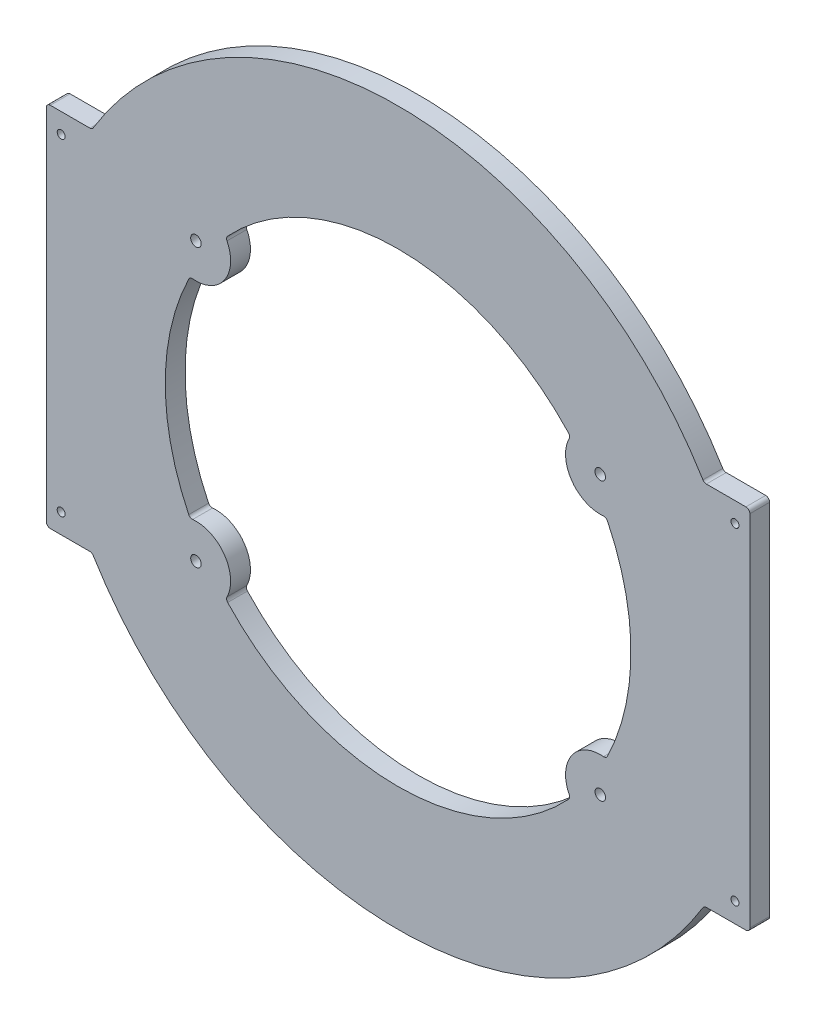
ISO-10303-21;
HEADER;
FILE_DESCRIPTION(('STEP AP214'),'2;1');
FILE_NAME('part.step','',(''),(''),'','','');
FILE_SCHEMA(('AUTOMOTIVE_DESIGN { 1 0 10303 214 1 1 1 1 }'));
ENDSEC;
DATA;
#1=APPLICATION_CONTEXT('core data for automotive mechanical design processes');
#2=APPLICATION_PROTOCOL_DEFINITION('international standard','automotive_design',2000,#1);
#3=PRODUCT_CONTEXT('',#1,'mechanical');
#4=PRODUCT('Part','Part','',(#3));
#5=PRODUCT_RELATED_PRODUCT_CATEGORY('part','',(#4));
#6=PRODUCT_DEFINITION_FORMATION('','',#4);
#7=PRODUCT_DEFINITION_CONTEXT('part definition',#1,'design');
#8=PRODUCT_DEFINITION('design','',#6,#7);
#9=PRODUCT_DEFINITION_SHAPE('','',#8);
#10=(LENGTH_UNIT() NAMED_UNIT(*) SI_UNIT(.MILLI.,.METRE.));
#11=(NAMED_UNIT(*) PLANE_ANGLE_UNIT() SI_UNIT($,.RADIAN.));
#12=(NAMED_UNIT(*) SI_UNIT($,.STERADIAN.) SOLID_ANGLE_UNIT());
#13=UNCERTAINTY_MEASURE_WITH_UNIT(LENGTH_MEASURE(1.E-05),#10,'distance_accuracy_value','');
#14=(GEOMETRIC_REPRESENTATION_CONTEXT(3) GLOBAL_UNCERTAINTY_ASSIGNED_CONTEXT((#13)) GLOBAL_UNIT_ASSIGNED_CONTEXT((#10,
#11,#12)) REPRESENTATION_CONTEXT('',''));
#15=CARTESIAN_POINT('',(0.,0.,0.));
#16=DIRECTION('',(0.,0.,1.));
#17=DIRECTION('',(1.,0.,0.));
#18=AXIS2_PLACEMENT_3D('',#15,#16,#17);
#19=CARTESIAN_POINT('',(0.,0.,12.7));
#20=DIRECTION('',(0.,0.,1.));
#21=DIRECTION('',(1.,0.,0.));
#22=AXIS2_PLACEMENT_3D('',#19,#20,#21);
#23=PLANE('',#22);
#24=CARTESIAN_POINT('',(215.9,104.775,12.7));
#25=DIRECTION('',(0.,0.,1.));
#26=DIRECTION('',(1.,0.,0.));
#27=AXIS2_PLACEMENT_3D('',#24,#25,#26);
#28=CIRCLE('',#27,2.55269999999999);
#29=CARTESIAN_POINT('',(218.4527,104.775,12.7));
#30=VERTEX_POINT('',#29);
#31=EDGE_CURVE('E551',#30,#30,#28,.T.);
#32=ORIENTED_EDGE('',*,*,#31,.F.);
#33=EDGE_LOOP('',(#32));
#34=FACE_BOUND('',#33,.T.);
#35=CARTESIAN_POINT('',(215.9,-104.775,12.7));
#36=DIRECTION('',(0.,0.,1.));
#37=DIRECTION('',(1.,0.,0.));
#38=AXIS2_PLACEMENT_3D('',#35,#36,#37);
#39=CIRCLE('',#38,2.55269999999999);
#40=CARTESIAN_POINT('',(218.4527,-104.775,12.7));
#41=VERTEX_POINT('',#40);
#42=EDGE_CURVE('E545',#41,#41,#39,.T.);
#43=ORIENTED_EDGE('',*,*,#42,.F.);
#44=EDGE_LOOP('',(#43));
#45=FACE_BOUND('',#44,.T.);
#46=CARTESIAN_POINT('',(-215.9,-104.775,12.7));
#47=DIRECTION('',(0.,0.,1.));
#48=DIRECTION('',(1.,0.,0.));
#49=AXIS2_PLACEMENT_3D('',#46,#47,#48);
#50=CIRCLE('',#49,2.55269999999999);
#51=CARTESIAN_POINT('',(-213.3473,-104.775,12.7));
#52=VERTEX_POINT('',#51);
#53=EDGE_CURVE('E539',#52,#52,#50,.T.);
#54=ORIENTED_EDGE('',*,*,#53,.F.);
#55=EDGE_LOOP('',(#54));
#56=FACE_BOUND('',#55,.T.);
#57=CARTESIAN_POINT('',(-215.9,104.775,12.7));
#58=DIRECTION('',(0.,0.,1.));
#59=DIRECTION('',(1.,0.,0.));
#60=AXIS2_PLACEMENT_3D('',#57,#58,#59);
#61=CIRCLE('',#60,2.55269999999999);
#62=CARTESIAN_POINT('',(-213.3473,104.775,12.7));
#63=VERTEX_POINT('',#62);
#64=EDGE_CURVE('E533',#63,#63,#61,.T.);
#65=ORIENTED_EDGE('',*,*,#64,.F.);
#66=EDGE_LOOP('',(#65));
#67=FACE_BOUND('',#66,.T.);
#68=CARTESIAN_POINT('',(0.,0.,12.7));
#69=DIRECTION('',(0.,0.,1.));
#70=DIRECTION('',(1.,0.,0.));
#71=AXIS2_PLACEMENT_3D('',#68,#69,#70);
#72=CIRCLE('',#71,149.225);
#73=CARTESIAN_POINT('',(109.230774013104,101.669752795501,12.7));
#74=VERTEX_POINT('',#73);
#75=CARTESIAN_POINT('',(-109.230774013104,101.669752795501,12.7));
#76=VERTEX_POINT('',#75);
#77=EDGE_CURVE('E433',#74,#76,#72,.T.);
#78=ORIENTED_EDGE('',*,*,#77,.F.);
#79=CARTESIAN_POINT('',(107.371526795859,99.9392038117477,12.7));
#80=DIRECTION('',(0.,0.,1.));
#81=DIRECTION('',(1.,0.,0.));
#82=AXIS2_PLACEMENT_3D('',#79,#80,#81);
#83=CIRCLE('',#82,2.54);
#84=CARTESIAN_POINT('',(109.645216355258,98.8069777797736,12.7));
#85=VERTEX_POINT('',#84);
#86=EDGE_CURVE('E386',#74,#85,#83,.F.);
#87=ORIENTED_EDGE('',*,*,#86,.T.);
#88=CARTESIAN_POINT('',(129.54,88.9000000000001,12.7));
#89=DIRECTION('',(0.,0.,1.));
#90=DIRECTION('',(1.,0.,0.));
#91=AXIS2_PLACEMENT_3D('',#88,#89,#90);
#92=CIRCLE('',#91,22.225);
#93=CARTESIAN_POINT('',(131.629045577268,66.7733980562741,12.7));
#94=VERTEX_POINT('',#93);
#95=EDGE_CURVE('E409',#85,#94,#92,.T.);
#96=ORIENTED_EDGE('',*,*,#95,.T.);
#97=CARTESIAN_POINT('',(131.867793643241,64.2446435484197,12.7));
#98=DIRECTION('',(0.,0.,1.));
#99=DIRECTION('',(1.,0.,0.));
#100=AXIS2_PLACEMENT_3D('',#97,#98,#99);
#101=CIRCLE('',#100,2.54);
#102=CARTESIAN_POINT('',(134.151218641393,65.3571049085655,12.7));
#103=VERTEX_POINT('',#102);
#104=EDGE_CURVE('E380',#94,#103,#101,.F.);
#105=ORIENTED_EDGE('',*,*,#104,.T.);
#106=CARTESIAN_POINT('',(134.151218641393,-65.3571049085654,12.7));
#107=VERTEX_POINT('',#106);
#108=EDGE_CURVE('E438',#107,#103,#72,.T.);
#109=ORIENTED_EDGE('',*,*,#108,.F.);
#110=CARTESIAN_POINT('',(131.867793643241,-64.2446435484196,12.7));
#111=DIRECTION('',(0.,0.,1.));
#112=DIRECTION('',(1.,0.,0.));
#113=AXIS2_PLACEMENT_3D('',#110,#111,#112);
#114=CIRCLE('',#113,2.54);
#115=CARTESIAN_POINT('',(131.629045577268,-66.773398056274,12.7));
#116=VERTEX_POINT('',#115);
#117=EDGE_CURVE('E390',#107,#116,#114,.F.);
#118=ORIENTED_EDGE('',*,*,#117,.T.);
#119=CARTESIAN_POINT('',(129.54,-88.9,12.7));
#120=DIRECTION('',(0.,0.,1.));
#121=DIRECTION('',(1.,0.,0.));
#122=AXIS2_PLACEMENT_3D('',#119,#120,#121);
#123=CIRCLE('',#122,22.225);
#124=CARTESIAN_POINT('',(109.645216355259,-98.8069777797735,12.7));
#125=VERTEX_POINT('',#124);
#126=EDGE_CURVE('E496',#116,#125,#123,.T.);
#127=ORIENTED_EDGE('',*,*,#126,.T.);
#128=CARTESIAN_POINT('',(107.371526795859,-99.9392038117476,12.7));
#129=DIRECTION('',(0.,0.,1.));
#130=DIRECTION('',(1.,0.,0.));
#131=AXIS2_PLACEMENT_3D('',#128,#129,#130);
#132=CIRCLE('',#131,2.54);
#133=CARTESIAN_POINT('',(109.230774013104,-101.669752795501,12.7));
#134=VERTEX_POINT('',#133);
#135=EDGE_CURVE('E392',#125,#134,#132,.F.);
#136=ORIENTED_EDGE('',*,*,#135,.T.);
#137=CARTESIAN_POINT('',(-109.230774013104,-101.669752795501,12.7));
#138=VERTEX_POINT('',#137);
#139=EDGE_CURVE('E432',#138,#134,#72,.T.);
#140=ORIENTED_EDGE('',*,*,#139,.F.);
#141=CARTESIAN_POINT('',(-107.37152679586,-99.9392038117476,12.7));
#142=DIRECTION('',(0.,0.,1.));
#143=DIRECTION('',(1.,0.,0.));
#144=AXIS2_PLACEMENT_3D('',#141,#142,#143);
#145=CIRCLE('',#144,2.54);
#146=CARTESIAN_POINT('',(-109.645216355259,-98.8069777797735,12.7));
#147=VERTEX_POINT('',#146);
#148=EDGE_CURVE('E366',#138,#147,#145,.F.);
#149=ORIENTED_EDGE('',*,*,#148,.T.);
#150=CARTESIAN_POINT('',(-129.54,-88.8999999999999,12.7));
#151=DIRECTION('',(0.,0.,1.));
#152=DIRECTION('',(1.,0.,0.));
#153=AXIS2_PLACEMENT_3D('',#150,#151,#152);
#154=CIRCLE('',#153,22.225);
#155=CARTESIAN_POINT('',(-131.629045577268,-66.773398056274,12.7));
#156=VERTEX_POINT('',#155);
#157=EDGE_CURVE('E490',#147,#156,#154,.T.);
#158=ORIENTED_EDGE('',*,*,#157,.T.);
#159=CARTESIAN_POINT('',(-131.867793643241,-64.2446435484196,12.7));
#160=DIRECTION('',(0.,0.,1.));
#161=DIRECTION('',(1.,0.,0.));
#162=AXIS2_PLACEMENT_3D('',#159,#160,#161);
#163=CIRCLE('',#162,2.54);
#164=CARTESIAN_POINT('',(-134.151218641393,-65.3571049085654,12.7));
#165=VERTEX_POINT('',#164);
#166=EDGE_CURVE('E368',#156,#165,#163,.F.);
#167=ORIENTED_EDGE('',*,*,#166,.T.);
#168=CARTESIAN_POINT('',(-134.151218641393,65.3571049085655,12.7));
#169=VERTEX_POINT('',#168);
#170=EDGE_CURVE('E428',#169,#165,#72,.T.);
#171=ORIENTED_EDGE('',*,*,#170,.F.);
#172=CARTESIAN_POINT('',(-131.867793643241,64.2446435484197,12.7));
#173=DIRECTION('',(0.,0.,1.));
#174=DIRECTION('',(1.,0.,0.));
#175=AXIS2_PLACEMENT_3D('',#172,#173,#174);
#176=CIRCLE('',#175,2.54);
#177=CARTESIAN_POINT('',(-131.629045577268,66.7733980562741,12.7));
#178=VERTEX_POINT('',#177);
#179=EDGE_CURVE('E374',#169,#178,#176,.F.);
#180=ORIENTED_EDGE('',*,*,#179,.T.);
#181=CARTESIAN_POINT('',(-129.54,88.9000000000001,12.7));
#182=DIRECTION('',(0.,0.,1.));
#183=DIRECTION('',(1.,0.,0.));
#184=AXIS2_PLACEMENT_3D('',#181,#182,#183);
#185=CIRCLE('',#184,22.225);
#186=CARTESIAN_POINT('',(-109.645216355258,98.8069777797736,12.7));
#187=VERTEX_POINT('',#186);
#188=EDGE_CURVE('E484',#178,#187,#185,.T.);
#189=ORIENTED_EDGE('',*,*,#188,.T.);
#190=CARTESIAN_POINT('',(-107.371526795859,99.9392038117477,12.7));
#191=DIRECTION('',(0.,0.,1.));
#192=DIRECTION('',(1.,0.,0.));
#193=AXIS2_PLACEMENT_3D('',#190,#191,#192);
#194=CIRCLE('',#193,2.54);
#195=EDGE_CURVE('E376',#187,#76,#194,.F.);
#196=ORIENTED_EDGE('',*,*,#195,.T.);
#197=EDGE_LOOP('',(#78,#87,#96,#105,#109,#118,#127,#136,#140,#149,#158,#167,#171,#180,#189,#196));
#198=FACE_BOUND('',#197,.T.);
#199=CARTESIAN_POINT('',(-129.54,88.9000000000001,12.7));
#200=DIRECTION('',(0.,0.,1.));
#201=DIRECTION('',(1.,0.,0.));
#202=AXIS2_PLACEMENT_3D('',#199,#200,#201);
#203=CIRCLE('',#202,3.3782);
#204=CARTESIAN_POINT('',(-126.1618,88.9000000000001,12.7));
#205=VERTEX_POINT('',#204);
#206=EDGE_CURVE('E480',#205,#205,#203,.T.);
#207=ORIENTED_EDGE('',*,*,#206,.F.);
#208=EDGE_LOOP('',(#207));
#209=FACE_BOUND('',#208,.T.);
#210=CARTESIAN_POINT('',(-129.54,-88.8999999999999,12.7));
#211=DIRECTION('',(0.,0.,1.));
#212=DIRECTION('',(1.,0.,0.));
#213=AXIS2_PLACEMENT_3D('',#210,#211,#212);
#214=CIRCLE('',#213,3.3782);
#215=CARTESIAN_POINT('',(-126.1618,-88.8999999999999,12.7));
#216=VERTEX_POINT('',#215);
#217=EDGE_CURVE('E474',#216,#216,#214,.T.);
#218=ORIENTED_EDGE('',*,*,#217,.F.);
#219=EDGE_LOOP('',(#218));
#220=FACE_BOUND('',#219,.T.);
#221=CARTESIAN_POINT('',(129.54,-88.9,12.7));
#222=DIRECTION('',(0.,0.,1.));
#223=DIRECTION('',(1.,0.,0.));
#224=AXIS2_PLACEMENT_3D('',#221,#222,#223);
#225=CIRCLE('',#224,3.3782);
#226=CARTESIAN_POINT('',(132.9182,-88.9,12.7));
#227=VERTEX_POINT('',#226);
#228=EDGE_CURVE('E468',#227,#227,#225,.T.);
#229=ORIENTED_EDGE('',*,*,#228,.F.);
#230=EDGE_LOOP('',(#229));
#231=FACE_BOUND('',#230,.T.);
#232=CARTESIAN_POINT('',(129.54,88.9000000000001,12.7));
#233=DIRECTION('',(0.,0.,1.));
#234=DIRECTION('',(1.,0.,0.));
#235=AXIS2_PLACEMENT_3D('',#232,#233,#234);
#236=CIRCLE('',#235,3.3782);
#237=CARTESIAN_POINT('',(132.9182,88.9000000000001,12.7));
#238=VERTEX_POINT('',#237);
#239=EDGE_CURVE('E459',#238,#238,#236,.T.);
#240=ORIENTED_EDGE('',*,*,#239,.F.);
#241=EDGE_LOOP('',(#240));
#242=FACE_BOUND('',#241,.T.);
#243=DIRECTION('',(0.,1.,0.));
#244=VECTOR('',#243,1.);
#245=CARTESIAN_POINT('',(225.425,117.475,12.7));
#246=LINE('',#245,#244);
#247=CARTESIAN_POINT('',(225.425,-114.935,12.7));
#248=VERTEX_POINT('',#247);
#249=CARTESIAN_POINT('',(225.425,114.935,12.7));
#250=VERTEX_POINT('',#249);
#251=EDGE_CURVE('E510',#248,#250,#246,.T.);
#252=ORIENTED_EDGE('',*,*,#251,.T.);
#253=CARTESIAN_POINT('',(222.885,114.935,12.7));
#254=DIRECTION('',(0.,0.,1.));
#255=DIRECTION('',(1.,0.,0.));
#256=AXIS2_PLACEMENT_3D('',#253,#254,#255);
#257=CIRCLE('',#256,2.54);
#258=CARTESIAN_POINT('',(222.885,117.475,12.7));
#259=VERTEX_POINT('',#258);
#260=EDGE_CURVE('E266',#250,#259,#257,.T.);
#261=ORIENTED_EDGE('',*,*,#260,.T.);
#262=DIRECTION('',(-1.,0.,0.));
#263=VECTOR('',#262,1.);
#264=CARTESIAN_POINT('',(225.425,117.475,12.7));
#265=LINE('',#264,#263);
#266=CARTESIAN_POINT('',(197.540120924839,117.475,12.7));
#267=VERTEX_POINT('',#266);
#268=EDGE_CURVE('E416',#259,#267,#265,.T.);
#269=ORIENTED_EDGE('',*,*,#268,.T.);
#270=CARTESIAN_POINT('',(197.540120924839,120.015,12.7));
#271=DIRECTION('',(0.,0.,1.));
#272=DIRECTION('',(1.,0.,0.));
#273=AXIS2_PLACEMENT_3D('',#270,#271,#272);
#274=CIRCLE('',#273,2.54);
#275=CARTESIAN_POINT('',(195.369350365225,118.696153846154,12.7));
#276=VERTEX_POINT('',#275);
#277=EDGE_CURVE('E11',#267,#276,#274,.F.);
#278=ORIENTED_EDGE('',*,*,#277,.T.);
#279=CARTESIAN_POINT('',(0.,0.,12.7));
#280=DIRECTION('',(0.,0.,1.));
#281=DIRECTION('',(1.,0.,0.));
#282=AXIS2_PLACEMENT_3D('',#279,#280,#281);
#283=CIRCLE('',#282,228.6);
#284=CARTESIAN_POINT('',(-195.369350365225,118.696153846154,12.7));
#285=VERTEX_POINT('',#284);
#286=EDGE_CURVE('E271',#276,#285,#283,.T.);
#287=ORIENTED_EDGE('',*,*,#286,.T.);
#288=CARTESIAN_POINT('',(-197.540120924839,120.015,12.7));
#289=DIRECTION('',(0.,0.,1.));
#290=DIRECTION('',(1.,0.,0.));
#291=AXIS2_PLACEMENT_3D('',#288,#289,#290);
#292=CIRCLE('',#291,2.54);
#293=CARTESIAN_POINT('',(-197.540120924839,117.475,12.7));
#294=VERTEX_POINT('',#293);
#295=EDGE_CURVE('E362',#285,#294,#292,.F.);
#296=ORIENTED_EDGE('',*,*,#295,.T.);
#297=DIRECTION('',(1.,0.,0.));
#298=VECTOR('',#297,1.);
#299=CARTESIAN_POINT('',(-225.425,117.475,12.7));
#300=LINE('',#299,#298);
#301=CARTESIAN_POINT('',(-222.885,117.475,12.7));
#302=VERTEX_POINT('',#301);
#303=EDGE_CURVE('E518',#302,#294,#300,.T.);
#304=ORIENTED_EDGE('',*,*,#303,.F.);
#305=CARTESIAN_POINT('',(-222.885,114.935,12.7));
#306=DIRECTION('',(0.,0.,1.));
#307=DIRECTION('',(1.,0.,0.));
#308=AXIS2_PLACEMENT_3D('',#305,#306,#307);
#309=CIRCLE('',#308,2.54);
#310=CARTESIAN_POINT('',(-225.425,114.935,12.7));
#311=VERTEX_POINT('',#310);
#312=EDGE_CURVE('E269',#302,#311,#309,.T.);
#313=ORIENTED_EDGE('',*,*,#312,.T.);
#314=DIRECTION('',(0.,1.,0.));
#315=VECTOR('',#314,1.);
#316=CARTESIAN_POINT('',(-225.425,117.475,12.7));
#317=LINE('',#316,#315);
#318=CARTESIAN_POINT('',(-225.425,-114.935,12.7));
#319=VERTEX_POINT('',#318);
#320=EDGE_CURVE('E523',#319,#311,#317,.T.);
#321=ORIENTED_EDGE('',*,*,#320,.F.);
#322=CARTESIAN_POINT('',(-222.885,-114.935,12.7));
#323=DIRECTION('',(0.,0.,1.));
#324=DIRECTION('',(1.,0.,0.));
#325=AXIS2_PLACEMENT_3D('',#322,#323,#324);
#326=CIRCLE('',#325,2.54);
#327=CARTESIAN_POINT('',(-222.885,-117.475,12.7));
#328=VERTEX_POINT('',#327);
#329=EDGE_CURVE('E267',#319,#328,#326,.T.);
#330=ORIENTED_EDGE('',*,*,#329,.T.);
#331=DIRECTION('',(-1.,0.,0.));
#332=VECTOR('',#331,1.);
#333=CARTESIAN_POINT('',(-225.425,-117.475,12.7));
#334=LINE('',#333,#332);
#335=CARTESIAN_POINT('',(-197.540120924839,-117.475,12.7));
#336=VERTEX_POINT('',#335);
#337=EDGE_CURVE('E521',#336,#328,#334,.T.);
#338=ORIENTED_EDGE('',*,*,#337,.F.);
#339=CARTESIAN_POINT('',(-197.540120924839,-120.015,12.7));
#340=DIRECTION('',(0.,0.,1.));
#341=DIRECTION('',(1.,0.,0.));
#342=AXIS2_PLACEMENT_3D('',#339,#340,#341);
#343=CIRCLE('',#342,2.54);
#344=CARTESIAN_POINT('',(-195.369350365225,-118.696153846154,12.7));
#345=VERTEX_POINT('',#344);
#346=EDGE_CURVE('E357',#336,#345,#343,.F.);
#347=ORIENTED_EDGE('',*,*,#346,.T.);
#348=CARTESIAN_POINT('',(195.369350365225,-118.696153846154,12.7));
#349=VERTEX_POINT('',#348);
#350=EDGE_CURVE('E420',#345,#349,#283,.T.);
#351=ORIENTED_EDGE('',*,*,#350,.T.);
#352=CARTESIAN_POINT('',(197.540120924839,-120.015,12.7));
#353=DIRECTION('',(0.,0.,1.));
#354=DIRECTION('',(1.,0.,0.));
#355=AXIS2_PLACEMENT_3D('',#352,#353,#354);
#356=CIRCLE('',#355,2.54);
#357=CARTESIAN_POINT('',(197.540120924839,-117.475,12.7));
#358=VERTEX_POINT('',#357);
#359=EDGE_CURVE('E396',#349,#358,#356,.F.);
#360=ORIENTED_EDGE('',*,*,#359,.T.);
#361=DIRECTION('',(1.,0.,0.));
#362=VECTOR('',#361,1.);
#363=CARTESIAN_POINT('',(225.425,-117.475,12.7));
#364=LINE('',#363,#362);
#365=CARTESIAN_POINT('',(222.885,-117.475,12.7));
#366=VERTEX_POINT('',#365);
#367=EDGE_CURVE('E506',#358,#366,#364,.T.);
#368=ORIENTED_EDGE('',*,*,#367,.T.);
#369=CARTESIAN_POINT('',(222.885,-114.935,12.7));
#370=DIRECTION('',(0.,0.,1.));
#371=DIRECTION('',(1.,0.,0.));
#372=AXIS2_PLACEMENT_3D('',#369,#370,#371);
#373=CIRCLE('',#372,2.54);
#374=EDGE_CURVE('E276',#366,#248,#373,.T.);
#375=ORIENTED_EDGE('',*,*,#374,.T.);
#376=EDGE_LOOP('',(#252,#261,#269,#278,#287,#296,#304,#313,#321,#330,#338,#347,#351,#360,#368,#375));
#377=FACE_BOUND('',#376,.T.);
#378=ADVANCED_FACE('F32',(#34,#45,#56,#67,#198,#209,#220,#231,#242,#377),#23,.T.);
#379=CARTESIAN_POINT('',(0.,0.,0.));
#380=DIRECTION('',(0.,0.,1.));
#381=DIRECTION('',(1.,0.,0.));
#382=AXIS2_PLACEMENT_3D('',#379,#380,#381);
#383=PLANE('',#382);
#384=CARTESIAN_POINT('',(215.9,104.775,0.));
#385=DIRECTION('',(0.,0.,1.));
#386=DIRECTION('',(1.,0.,0.));
#387=AXIS2_PLACEMENT_3D('',#384,#385,#386);
#388=CIRCLE('',#387,2.55269999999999);
#389=CARTESIAN_POINT('',(218.4527,104.775,0.));
#390=VERTEX_POINT('',#389);
#391=EDGE_CURVE('E548',#390,#390,#388,.T.);
#392=ORIENTED_EDGE('',*,*,#391,.T.);
#393=EDGE_LOOP('',(#392));
#394=FACE_BOUND('',#393,.T.);
#395=CARTESIAN_POINT('',(215.9,-104.775,0.));
#396=DIRECTION('',(0.,0.,1.));
#397=DIRECTION('',(1.,0.,0.));
#398=AXIS2_PLACEMENT_3D('',#395,#396,#397);
#399=CIRCLE('',#398,2.55269999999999);
#400=CARTESIAN_POINT('',(218.4527,-104.775,0.));
#401=VERTEX_POINT('',#400);
#402=EDGE_CURVE('E542',#401,#401,#399,.T.);
#403=ORIENTED_EDGE('',*,*,#402,.T.);
#404=EDGE_LOOP('',(#403));
#405=FACE_BOUND('',#404,.T.);
#406=CARTESIAN_POINT('',(-215.9,-104.775,0.));
#407=DIRECTION('',(0.,0.,1.));
#408=DIRECTION('',(1.,0.,0.));
#409=AXIS2_PLACEMENT_3D('',#406,#407,#408);
#410=CIRCLE('',#409,2.55269999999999);
#411=CARTESIAN_POINT('',(-213.3473,-104.775,0.));
#412=VERTEX_POINT('',#411);
#413=EDGE_CURVE('E536',#412,#412,#410,.T.);
#414=ORIENTED_EDGE('',*,*,#413,.T.);
#415=EDGE_LOOP('',(#414));
#416=FACE_BOUND('',#415,.T.);
#417=CARTESIAN_POINT('',(-215.9,104.775,0.));
#418=DIRECTION('',(0.,0.,1.));
#419=DIRECTION('',(1.,0.,0.));
#420=AXIS2_PLACEMENT_3D('',#417,#418,#419);
#421=CIRCLE('',#420,2.55269999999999);
#422=CARTESIAN_POINT('',(-213.3473,104.775,0.));
#423=VERTEX_POINT('',#422);
#424=EDGE_CURVE('E526',#423,#423,#421,.T.);
#425=ORIENTED_EDGE('',*,*,#424,.T.);
#426=EDGE_LOOP('',(#425));
#427=FACE_BOUND('',#426,.T.);
#428=CARTESIAN_POINT('',(129.54,-88.9,0.));
#429=DIRECTION('',(0.,0.,1.));
#430=DIRECTION('',(1.,0.,0.));
#431=AXIS2_PLACEMENT_3D('',#428,#429,#430);
#432=CIRCLE('',#431,22.225);
#433=CARTESIAN_POINT('',(131.629045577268,-66.773398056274,0.));
#434=VERTEX_POINT('',#433);
#435=CARTESIAN_POINT('',(109.645216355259,-98.8069777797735,0.));
#436=VERTEX_POINT('',#435);
#437=EDGE_CURVE('E493',#434,#436,#432,.T.);
#438=ORIENTED_EDGE('',*,*,#437,.F.);
#439=CARTESIAN_POINT('',(131.867793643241,-64.2446435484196,0.));
#440=DIRECTION('',(0.,0.,1.));
#441=DIRECTION('',(1.,0.,0.));
#442=AXIS2_PLACEMENT_3D('',#439,#440,#441);
#443=CIRCLE('',#442,2.54);
#444=CARTESIAN_POINT('',(134.151218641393,-65.3571049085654,0.));
#445=VERTEX_POINT('',#444);
#446=EDGE_CURVE('E388',#434,#445,#443,.T.);
#447=ORIENTED_EDGE('',*,*,#446,.T.);
#448=CARTESIAN_POINT('',(0.,0.,0.));
#449=DIRECTION('',(0.,0.,1.));
#450=DIRECTION('',(1.,0.,0.));
#451=AXIS2_PLACEMENT_3D('',#448,#449,#450);
#452=CIRCLE('',#451,149.225);
#453=CARTESIAN_POINT('',(134.151218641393,65.3571049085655,0.));
#454=VERTEX_POINT('',#453);
#455=EDGE_CURVE('E452',#445,#454,#452,.T.);
#456=ORIENTED_EDGE('',*,*,#455,.T.);
#457=CARTESIAN_POINT('',(131.867793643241,64.2446435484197,0.));
#458=DIRECTION('',(0.,0.,1.));
#459=DIRECTION('',(1.,0.,0.));
#460=AXIS2_PLACEMENT_3D('',#457,#458,#459);
#461=CIRCLE('',#460,2.54);
#462=CARTESIAN_POINT('',(131.629045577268,66.7733980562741,0.));
#463=VERTEX_POINT('',#462);
#464=EDGE_CURVE('E382',#454,#463,#461,.T.);
#465=ORIENTED_EDGE('',*,*,#464,.T.);
#466=CARTESIAN_POINT('',(129.54,88.9000000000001,0.));
#467=DIRECTION('',(0.,0.,1.));
#468=DIRECTION('',(1.,0.,0.));
#469=AXIS2_PLACEMENT_3D('',#466,#467,#468);
#470=CIRCLE('',#469,22.225);
#471=CARTESIAN_POINT('',(109.645216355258,98.8069777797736,0.));
#472=VERTEX_POINT('',#471);
#473=EDGE_CURVE('E499',#472,#463,#470,.T.);
#474=ORIENTED_EDGE('',*,*,#473,.F.);
#475=CARTESIAN_POINT('',(107.371526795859,99.9392038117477,0.));
#476=DIRECTION('',(0.,0.,1.));
#477=DIRECTION('',(1.,0.,0.));
#478=AXIS2_PLACEMENT_3D('',#475,#476,#477);
#479=CIRCLE('',#478,2.54);
#480=CARTESIAN_POINT('',(109.230774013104,101.669752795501,0.));
#481=VERTEX_POINT('',#480);
#482=EDGE_CURVE('E384',#472,#481,#479,.T.);
#483=ORIENTED_EDGE('',*,*,#482,.T.);
#484=CARTESIAN_POINT('',(-109.230774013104,101.669752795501,0.));
#485=VERTEX_POINT('',#484);
#486=EDGE_CURVE('E447',#481,#485,#452,.T.);
#487=ORIENTED_EDGE('',*,*,#486,.T.);
#488=CARTESIAN_POINT('',(-107.371526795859,99.9392038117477,0.));
#489=DIRECTION('',(0.,0.,1.));
#490=DIRECTION('',(1.,0.,0.));
#491=AXIS2_PLACEMENT_3D('',#488,#489,#490);
#492=CIRCLE('',#491,2.54);
#493=CARTESIAN_POINT('',(-109.645216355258,98.8069777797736,0.));
#494=VERTEX_POINT('',#493);
#495=EDGE_CURVE('E378',#485,#494,#492,.T.);
#496=ORIENTED_EDGE('',*,*,#495,.T.);
#497=CARTESIAN_POINT('',(-129.54,88.9000000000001,0.));
#498=DIRECTION('',(0.,0.,1.));
#499=DIRECTION('',(1.,0.,0.));
#500=AXIS2_PLACEMENT_3D('',#497,#498,#499);
#501=CIRCLE('',#500,22.225);
#502=CARTESIAN_POINT('',(-131.629045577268,66.7733980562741,0.));
#503=VERTEX_POINT('',#502);
#504=EDGE_CURVE('E483',#503,#494,#501,.T.);
#505=ORIENTED_EDGE('',*,*,#504,.F.);
#506=CARTESIAN_POINT('',(-131.867793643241,64.2446435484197,0.));
#507=DIRECTION('',(0.,0.,1.));
#508=DIRECTION('',(1.,0.,0.));
#509=AXIS2_PLACEMENT_3D('',#506,#507,#508);
#510=CIRCLE('',#509,2.54);
#511=CARTESIAN_POINT('',(-134.151218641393,65.3571049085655,0.));
#512=VERTEX_POINT('',#511);
#513=EDGE_CURVE('E372',#503,#512,#510,.T.);
#514=ORIENTED_EDGE('',*,*,#513,.T.);
#515=CARTESIAN_POINT('',(-134.151218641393,-65.3571049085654,0.));
#516=VERTEX_POINT('',#515);
#517=EDGE_CURVE('E441',#512,#516,#452,.T.);
#518=ORIENTED_EDGE('',*,*,#517,.T.);
#519=CARTESIAN_POINT('',(-131.867793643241,-64.2446435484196,0.));
#520=DIRECTION('',(0.,0.,1.));
#521=DIRECTION('',(1.,0.,0.));
#522=AXIS2_PLACEMENT_3D('',#519,#520,#521);
#523=CIRCLE('',#522,2.54);
#524=CARTESIAN_POINT('',(-131.629045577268,-66.773398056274,0.));
#525=VERTEX_POINT('',#524);
#526=EDGE_CURVE('E370',#516,#525,#523,.T.);
#527=ORIENTED_EDGE('',*,*,#526,.T.);
#528=CARTESIAN_POINT('',(-129.54,-88.8999999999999,0.));
#529=DIRECTION('',(0.,0.,1.));
#530=DIRECTION('',(1.,0.,0.));
#531=AXIS2_PLACEMENT_3D('',#528,#529,#530);
#532=CIRCLE('',#531,22.225);
#533=CARTESIAN_POINT('',(-109.645216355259,-98.8069777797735,0.));
#534=VERTEX_POINT('',#533);
#535=EDGE_CURVE('E487',#534,#525,#532,.T.);
#536=ORIENTED_EDGE('',*,*,#535,.F.);
#537=CARTESIAN_POINT('',(-107.37152679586,-99.9392038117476,0.));
#538=DIRECTION('',(0.,0.,1.));
#539=DIRECTION('',(1.,0.,0.));
#540=AXIS2_PLACEMENT_3D('',#537,#538,#539);
#541=CIRCLE('',#540,2.54);
#542=CARTESIAN_POINT('',(-109.230774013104,-101.669752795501,0.));
#543=VERTEX_POINT('',#542);
#544=EDGE_CURVE('E364',#534,#543,#541,.T.);
#545=ORIENTED_EDGE('',*,*,#544,.T.);
#546=CARTESIAN_POINT('',(109.230774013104,-101.669752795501,0.));
#547=VERTEX_POINT('',#546);
#548=EDGE_CURVE('E424',#543,#547,#452,.T.);
#549=ORIENTED_EDGE('',*,*,#548,.T.);
#550=CARTESIAN_POINT('',(107.371526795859,-99.9392038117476,0.));
#551=DIRECTION('',(0.,0.,1.));
#552=DIRECTION('',(1.,0.,0.));
#553=AXIS2_PLACEMENT_3D('',#550,#551,#552);
#554=CIRCLE('',#553,2.54);
#555=EDGE_CURVE('E394',#547,#436,#554,.T.);
#556=ORIENTED_EDGE('',*,*,#555,.T.);
#557=EDGE_LOOP('',(#438,#447,#456,#465,#474,#483,#487,#496,#505,#514,#518,#527,#536,#545,#549,#556));
#558=FACE_BOUND('',#557,.T.);
#559=CARTESIAN_POINT('',(-129.54,88.9000000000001,0.));
#560=DIRECTION('',(0.,0.,1.));
#561=DIRECTION('',(1.,0.,0.));
#562=AXIS2_PLACEMENT_3D('',#559,#560,#561);
#563=CIRCLE('',#562,3.3782);
#564=CARTESIAN_POINT('',(-126.1618,88.9000000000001,0.));
#565=VERTEX_POINT('',#564);
#566=EDGE_CURVE('E477',#565,#565,#563,.T.);
#567=ORIENTED_EDGE('',*,*,#566,.T.);
#568=EDGE_LOOP('',(#567));
#569=FACE_BOUND('',#568,.T.);
#570=CARTESIAN_POINT('',(-129.54,-88.8999999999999,0.));
#571=DIRECTION('',(0.,0.,1.));
#572=DIRECTION('',(1.,0.,0.));
#573=AXIS2_PLACEMENT_3D('',#570,#571,#572);
#574=CIRCLE('',#573,3.3782);
#575=CARTESIAN_POINT('',(-126.1618,-88.8999999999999,0.));
#576=VERTEX_POINT('',#575);
#577=EDGE_CURVE('E471',#576,#576,#574,.T.);
#578=ORIENTED_EDGE('',*,*,#577,.T.);
#579=EDGE_LOOP('',(#578));
#580=FACE_BOUND('',#579,.T.);
#581=CARTESIAN_POINT('',(129.54,-88.9,0.));
#582=DIRECTION('',(0.,0.,1.));
#583=DIRECTION('',(1.,0.,0.));
#584=AXIS2_PLACEMENT_3D('',#581,#582,#583);
#585=CIRCLE('',#584,3.3782);
#586=CARTESIAN_POINT('',(132.9182,-88.9,0.));
#587=VERTEX_POINT('',#586);
#588=EDGE_CURVE('E463',#587,#587,#585,.T.);
#589=ORIENTED_EDGE('',*,*,#588,.T.);
#590=EDGE_LOOP('',(#589));
#591=FACE_BOUND('',#590,.T.);
#592=CARTESIAN_POINT('',(129.54,88.9000000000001,0.));
#593=DIRECTION('',(0.,0.,1.));
#594=DIRECTION('',(1.,0.,0.));
#595=AXIS2_PLACEMENT_3D('',#592,#593,#594);
#596=CIRCLE('',#595,3.3782);
#597=CARTESIAN_POINT('',(132.9182,88.9000000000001,0.));
#598=VERTEX_POINT('',#597);
#599=EDGE_CURVE('E454',#598,#598,#596,.T.);
#600=ORIENTED_EDGE('',*,*,#599,.T.);
#601=EDGE_LOOP('',(#600));
#602=FACE_BOUND('',#601,.T.);
#603=DIRECTION('',(1.,0.,0.));
#604=VECTOR('',#603,1.);
#605=CARTESIAN_POINT('',(225.425,117.475,0.));
#606=LINE('',#605,#604);
#607=CARTESIAN_POINT('',(197.540120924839,117.475,0.));
#608=VERTEX_POINT('',#607);
#609=CARTESIAN_POINT('',(222.885,117.475,0.));
#610=VERTEX_POINT('',#609);
#611=EDGE_CURVE('E248',#608,#610,#606,.T.);
#612=ORIENTED_EDGE('',*,*,#611,.T.);
#613=CARTESIAN_POINT('',(222.885,114.935,0.));
#614=DIRECTION('',(0.,0.,1.));
#615=DIRECTION('',(1.,0.,0.));
#616=AXIS2_PLACEMENT_3D('',#613,#614,#615);
#617=CIRCLE('',#616,2.54);
#618=CARTESIAN_POINT('',(225.425,114.935,0.));
#619=VERTEX_POINT('',#618);
#620=EDGE_CURVE('E242',#610,#619,#617,.F.);
#621=ORIENTED_EDGE('',*,*,#620,.T.);
#622=DIRECTION('',(0.,-1.,0.));
#623=VECTOR('',#622,1.);
#624=CARTESIAN_POINT('',(225.425,117.475,0.));
#625=LINE('',#624,#623);
#626=CARTESIAN_POINT('',(225.425,-114.935,0.));
#627=VERTEX_POINT('',#626);
#628=EDGE_CURVE('E245',#619,#627,#625,.T.);
#629=ORIENTED_EDGE('',*,*,#628,.T.);
#630=CARTESIAN_POINT('',(222.885,-114.935,0.));
#631=DIRECTION('',(0.,0.,1.));
#632=DIRECTION('',(1.,0.,0.));
#633=AXIS2_PLACEMENT_3D('',#630,#631,#632);
#634=CIRCLE('',#633,2.54);
#635=CARTESIAN_POINT('',(222.885,-117.475,0.));
#636=VERTEX_POINT('',#635);
#637=EDGE_CURVE('E253',#627,#636,#634,.F.);
#638=ORIENTED_EDGE('',*,*,#637,.T.);
#639=DIRECTION('',(-1.,0.,0.));
#640=VECTOR('',#639,1.);
#641=CARTESIAN_POINT('',(225.425,-117.475,0.));
#642=LINE('',#641,#640);
#643=CARTESIAN_POINT('',(197.540120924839,-117.475,0.));
#644=VERTEX_POINT('',#643);
#645=EDGE_CURVE('E263',#636,#644,#642,.T.);
#646=ORIENTED_EDGE('',*,*,#645,.T.);
#647=CARTESIAN_POINT('',(197.540120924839,-120.015,0.));
#648=DIRECTION('',(0.,0.,1.));
#649=DIRECTION('',(1.,0.,0.));
#650=AXIS2_PLACEMENT_3D('',#647,#648,#649);
#651=CIRCLE('',#650,2.54);
#652=CARTESIAN_POINT('',(195.369350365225,-118.696153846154,0.));
#653=VERTEX_POINT('',#652);
#654=EDGE_CURVE('E398',#644,#653,#651,.T.);
#655=ORIENTED_EDGE('',*,*,#654,.T.);
#656=CARTESIAN_POINT('',(0.,0.,0.));
#657=DIRECTION('',(0.,0.,1.));
#658=DIRECTION('',(1.,0.,0.));
#659=AXIS2_PLACEMENT_3D('',#656,#657,#658);
#660=CIRCLE('',#659,228.6);
#661=CARTESIAN_POINT('',(-195.369350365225,-118.696153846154,0.));
#662=VERTEX_POINT('',#661);
#663=EDGE_CURVE('E426',#662,#653,#660,.T.);
#664=ORIENTED_EDGE('',*,*,#663,.F.);
#665=CARTESIAN_POINT('',(-197.540120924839,-120.015,0.));
#666=DIRECTION('',(0.,0.,1.));
#667=DIRECTION('',(1.,0.,0.));
#668=AXIS2_PLACEMENT_3D('',#665,#666,#667);
#669=CIRCLE('',#668,2.54);
#670=CARTESIAN_POINT('',(-197.540120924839,-117.475,0.));
#671=VERTEX_POINT('',#670);
#672=EDGE_CURVE('E47',#662,#671,#669,.T.);
#673=ORIENTED_EDGE('',*,*,#672,.T.);
#674=DIRECTION('',(1.,0.,0.));
#675=VECTOR('',#674,1.);
#676=CARTESIAN_POINT('',(-225.425,-117.475,0.));
#677=LINE('',#676,#675);
#678=CARTESIAN_POINT('',(-222.885,-117.475,0.));
#679=VERTEX_POINT('',#678);
#680=EDGE_CURVE('E515',#679,#671,#677,.T.);
#681=ORIENTED_EDGE('',*,*,#680,.F.);
#682=CARTESIAN_POINT('',(-222.885,-114.935,0.));
#683=DIRECTION('',(0.,0.,1.));
#684=DIRECTION('',(1.,0.,0.));
#685=AXIS2_PLACEMENT_3D('',#682,#683,#684);
#686=CIRCLE('',#685,2.54);
#687=CARTESIAN_POINT('',(-225.425,-114.935,0.));
#688=VERTEX_POINT('',#687);
#689=EDGE_CURVE('E283',#679,#688,#686,.F.);
#690=ORIENTED_EDGE('',*,*,#689,.T.);
#691=DIRECTION('',(0.,-1.,0.));
#692=VECTOR('',#691,1.);
#693=CARTESIAN_POINT('',(-225.425,117.475,0.));
#694=LINE('',#693,#692);
#695=CARTESIAN_POINT('',(-225.425,114.935,0.));
#696=VERTEX_POINT('',#695);
#697=EDGE_CURVE('E511',#696,#688,#694,.T.);
#698=ORIENTED_EDGE('',*,*,#697,.F.);
#699=CARTESIAN_POINT('',(-222.885,114.935,0.));
#700=DIRECTION('',(0.,0.,1.));
#701=DIRECTION('',(1.,0.,0.));
#702=AXIS2_PLACEMENT_3D('',#699,#700,#701);
#703=CIRCLE('',#702,2.54);
#704=CARTESIAN_POINT('',(-222.885,117.475,0.));
#705=VERTEX_POINT('',#704);
#706=EDGE_CURVE('E285',#696,#705,#703,.F.);
#707=ORIENTED_EDGE('',*,*,#706,.T.);
#708=DIRECTION('',(-1.,0.,0.));
#709=VECTOR('',#708,1.);
#710=CARTESIAN_POINT('',(-225.425,117.475,0.));
#711=LINE('',#710,#709);
#712=CARTESIAN_POINT('',(-197.540120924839,117.475,0.));
#713=VERTEX_POINT('',#712);
#714=EDGE_CURVE('E517',#713,#705,#711,.T.);
#715=ORIENTED_EDGE('',*,*,#714,.F.);
#716=CARTESIAN_POINT('',(-197.540120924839,120.015,0.));
#717=DIRECTION('',(0.,0.,1.));
#718=DIRECTION('',(1.,0.,0.));
#719=AXIS2_PLACEMENT_3D('',#716,#717,#718);
#720=CIRCLE('',#719,2.54);
#721=CARTESIAN_POINT('',(-195.369350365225,118.696153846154,0.));
#722=VERTEX_POINT('',#721);
#723=EDGE_CURVE('E360',#713,#722,#720,.T.);
#724=ORIENTED_EDGE('',*,*,#723,.T.);
#725=CARTESIAN_POINT('',(195.369350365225,118.696153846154,0.));
#726=VERTEX_POINT('',#725);
#727=EDGE_CURVE('E401',#726,#722,#660,.T.);
#728=ORIENTED_EDGE('',*,*,#727,.F.);
#729=CARTESIAN_POINT('',(197.540120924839,120.015,0.));
#730=DIRECTION('',(0.,0.,1.));
#731=DIRECTION('',(1.,0.,0.));
#732=AXIS2_PLACEMENT_3D('',#729,#730,#731);
#733=CIRCLE('',#732,2.54);
#734=EDGE_CURVE('E40',#726,#608,#733,.T.);
#735=ORIENTED_EDGE('',*,*,#734,.T.);
#736=EDGE_LOOP('',(#612,#621,#629,#638,#646,#655,#664,#673,#681,#690,#698,#707,#715,#724,#728,#735));
#737=FACE_BOUND('',#736,.T.);
#738=ADVANCED_FACE('F244',(#394,#405,#416,#427,#558,#569,#580,#591,#602,#737),#383,.F.);
#739=CARTESIAN_POINT('',(0.,0.,12.7));
#740=DIRECTION('',(0.,0.,-1.));
#741=DIRECTION('',(-1.,0.,0.));
#742=AXIS2_PLACEMENT_3D('',#739,#740,#741);
#743=CYLINDRICAL_SURFACE('',#742,228.6);
#744=ORIENTED_EDGE('',*,*,#350,.F.);
#745=DIRECTION('',(0.,0.,-1.));
#746=VECTOR('',#745,1.);
#747=CARTESIAN_POINT('',(-195.369350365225,-118.696153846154,12.7));
#748=LINE('',#747,#746);
#749=EDGE_CURVE('E310',#345,#662,#748,.T.);
#750=ORIENTED_EDGE('',*,*,#749,.T.);
#751=ORIENTED_EDGE('',*,*,#663,.T.);
#752=DIRECTION('',(0.,0.,-1.));
#753=VECTOR('',#752,1.);
#754=CARTESIAN_POINT('',(195.369350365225,-118.696153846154,12.7));
#755=LINE('',#754,#753);
#756=EDGE_CURVE('E307',#653,#349,#755,.F.);
#757=ORIENTED_EDGE('',*,*,#756,.T.);
#758=EDGE_LOOP('',(#744,#750,#751,#757));
#759=FACE_BOUND('',#758,.T.);
#760=ADVANCED_FACE('F596',(#759),#743,.T.);
#761=ORIENTED_EDGE('',*,*,#727,.T.);
#762=DIRECTION('',(0.,0.,-1.));
#763=VECTOR('',#762,1.);
#764=CARTESIAN_POINT('',(-195.369350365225,118.696153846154,12.7));
#765=LINE('',#764,#763);
#766=EDGE_CURVE('E315',#722,#285,#765,.F.);
#767=ORIENTED_EDGE('',*,*,#766,.T.);
#768=ORIENTED_EDGE('',*,*,#286,.F.);
#769=DIRECTION('',(0.,0.,-1.));
#770=VECTOR('',#769,1.);
#771=CARTESIAN_POINT('',(195.369350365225,118.696153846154,12.7));
#772=LINE('',#771,#770);
#773=EDGE_CURVE('E312',#276,#726,#772,.T.);
#774=ORIENTED_EDGE('',*,*,#773,.T.);
#775=EDGE_LOOP('',(#761,#767,#768,#774));
#776=FACE_BOUND('',#775,.T.);
#777=ADVANCED_FACE('F418',(#776),#743,.T.);
#778=CARTESIAN_POINT('',(0.,0.,12.7));
#779=DIRECTION('',(0.,0.,-1.));
#780=DIRECTION('',(-1.,0.,0.));
#781=AXIS2_PLACEMENT_3D('',#778,#779,#780);
#782=CYLINDRICAL_SURFACE('',#781,149.225);
#783=ORIENTED_EDGE('',*,*,#108,.T.);
#784=DIRECTION('',(0.,0.,-1.));
#785=VECTOR('',#784,1.);
#786=CARTESIAN_POINT('',(134.151218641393,65.3571049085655,12.7));
#787=LINE('',#786,#785);
#788=EDGE_CURVE('E349',#103,#454,#787,.T.);
#789=ORIENTED_EDGE('',*,*,#788,.T.);
#790=ORIENTED_EDGE('',*,*,#455,.F.);
#791=DIRECTION('',(0.,0.,-1.));
#792=VECTOR('',#791,1.);
#793=CARTESIAN_POINT('',(134.151218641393,-65.3571049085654,12.7));
#794=LINE('',#793,#792);
#795=EDGE_CURVE('E347',#445,#107,#794,.F.);
#796=ORIENTED_EDGE('',*,*,#795,.T.);
#797=EDGE_LOOP('',(#783,#789,#790,#796));
#798=FACE_BOUND('',#797,.T.);
#799=ADVANCED_FACE('F591',(#798),#782,.F.);
#800=ORIENTED_EDGE('',*,*,#548,.F.);
#801=DIRECTION('',(0.,0.,-1.));
#802=VECTOR('',#801,1.);
#803=CARTESIAN_POINT('',(-109.230774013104,-101.669752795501,12.7));
#804=LINE('',#803,#802);
#805=EDGE_CURVE('E325',#543,#138,#804,.F.);
#806=ORIENTED_EDGE('',*,*,#805,.T.);
#807=ORIENTED_EDGE('',*,*,#139,.T.);
#808=DIRECTION('',(0.,0.,-1.));
#809=VECTOR('',#808,1.);
#810=CARTESIAN_POINT('',(109.230774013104,-101.669752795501,12.7));
#811=LINE('',#810,#809);
#812=EDGE_CURVE('E323',#134,#547,#811,.T.);
#813=ORIENTED_EDGE('',*,*,#812,.T.);
#814=EDGE_LOOP('',(#800,#806,#807,#813));
#815=FACE_BOUND('',#814,.T.);
#816=ADVANCED_FACE('F952',(#815),#782,.F.);
#817=ORIENTED_EDGE('',*,*,#170,.T.);
#818=DIRECTION('',(0.,0.,-1.));
#819=VECTOR('',#818,1.);
#820=CARTESIAN_POINT('',(-134.151218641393,-65.3571049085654,12.7));
#821=LINE('',#820,#819);
#822=EDGE_CURVE('E329',#165,#516,#821,.T.);
#823=ORIENTED_EDGE('',*,*,#822,.T.);
#824=ORIENTED_EDGE('',*,*,#517,.F.);
#825=DIRECTION('',(0.,0.,-1.));
#826=VECTOR('',#825,1.);
#827=CARTESIAN_POINT('',(-134.151218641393,65.3571049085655,12.7));
#828=LINE('',#827,#826);
#829=EDGE_CURVE('E327',#512,#169,#828,.F.);
#830=ORIENTED_EDGE('',*,*,#829,.T.);
#831=EDGE_LOOP('',(#817,#823,#824,#830));
#832=FACE_BOUND('',#831,.T.);
#833=ADVANCED_FACE('F589',(#832),#782,.F.);
#834=ORIENTED_EDGE('',*,*,#77,.T.);
#835=DIRECTION('',(0.,0.,-1.));
#836=VECTOR('',#835,1.);
#837=CARTESIAN_POINT('',(-109.230774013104,101.669752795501,12.7));
#838=LINE('',#837,#836);
#839=EDGE_CURVE('E339',#76,#485,#838,.T.);
#840=ORIENTED_EDGE('',*,*,#839,.T.);
#841=ORIENTED_EDGE('',*,*,#486,.F.);
#842=DIRECTION('',(0.,0.,-1.));
#843=VECTOR('',#842,1.);
#844=CARTESIAN_POINT('',(109.230774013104,101.669752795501,12.7));
#845=LINE('',#844,#843);
#846=EDGE_CURVE('E337',#481,#74,#845,.F.);
#847=ORIENTED_EDGE('',*,*,#846,.T.);
#848=EDGE_LOOP('',(#834,#840,#841,#847));
#849=FACE_BOUND('',#848,.T.);
#850=ADVANCED_FACE('F579',(#849),#782,.F.);
#851=CARTESIAN_POINT('',(129.54,88.9000000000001,12.7));
#852=DIRECTION('',(0.,0.,1.));
#853=DIRECTION('',(1.,0.,0.));
#854=AXIS2_PLACEMENT_3D('',#851,#852,#853);
#855=CYLINDRICAL_SURFACE('',#854,3.3782);
#856=ORIENTED_EDGE('',*,*,#599,.F.);
#857=EDGE_LOOP('',(#856));
#858=FACE_BOUND('',#857,.T.);
#859=ORIENTED_EDGE('',*,*,#239,.T.);
#860=EDGE_LOOP('',(#859));
#861=FACE_BOUND('',#860,.T.);
#862=ADVANCED_FACE('F576',(#858,#861),#855,.F.);
#863=CARTESIAN_POINT('',(129.54,-88.9,12.7));
#864=DIRECTION('',(0.,0.,1.));
#865=DIRECTION('',(1.,0.,0.));
#866=AXIS2_PLACEMENT_3D('',#863,#864,#865);
#867=CYLINDRICAL_SURFACE('',#866,3.3782);
#868=ORIENTED_EDGE('',*,*,#588,.F.);
#869=EDGE_LOOP('',(#868));
#870=FACE_BOUND('',#869,.T.);
#871=ORIENTED_EDGE('',*,*,#228,.T.);
#872=EDGE_LOOP('',(#871));
#873=FACE_BOUND('',#872,.T.);
#874=ADVANCED_FACE('F578',(#870,#873),#867,.F.);
#875=CARTESIAN_POINT('',(-129.54,-88.8999999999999,12.7));
#876=DIRECTION('',(0.,0.,1.));
#877=DIRECTION('',(1.,0.,0.));
#878=AXIS2_PLACEMENT_3D('',#875,#876,#877);
#879=CYLINDRICAL_SURFACE('',#878,3.3782);
#880=ORIENTED_EDGE('',*,*,#577,.F.);
#881=EDGE_LOOP('',(#880));
#882=FACE_BOUND('',#881,.T.);
#883=ORIENTED_EDGE('',*,*,#217,.T.);
#884=EDGE_LOOP('',(#883));
#885=FACE_BOUND('',#884,.T.);
#886=ADVANCED_FACE('F586',(#882,#885),#879,.F.);
#887=CARTESIAN_POINT('',(-129.54,88.9000000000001,12.7));
#888=DIRECTION('',(0.,0.,1.));
#889=DIRECTION('',(1.,0.,0.));
#890=AXIS2_PLACEMENT_3D('',#887,#888,#889);
#891=CYLINDRICAL_SURFACE('',#890,3.3782);
#892=ORIENTED_EDGE('',*,*,#566,.F.);
#893=EDGE_LOOP('',(#892));
#894=FACE_BOUND('',#893,.T.);
#895=ORIENTED_EDGE('',*,*,#206,.T.);
#896=EDGE_LOOP('',(#895));
#897=FACE_BOUND('',#896,.T.);
#898=ADVANCED_FACE('F718',(#894,#897),#891,.F.);
#899=CARTESIAN_POINT('',(-129.54,88.9000000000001,0.));
#900=DIRECTION('',(0.,0.,1.));
#901=DIRECTION('',(1.,0.,0.));
#902=AXIS2_PLACEMENT_3D('',#899,#900,#901);
#903=CYLINDRICAL_SURFACE('',#902,22.225);
#904=ORIENTED_EDGE('',*,*,#188,.F.);
#905=DIRECTION('',(0.,0.,1.));
#906=VECTOR('',#905,1.);
#907=CARTESIAN_POINT('',(-131.629045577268,66.7733980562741,0.));
#908=LINE('',#907,#906);
#909=EDGE_CURVE('E334',#178,#503,#908,.F.);
#910=ORIENTED_EDGE('',*,*,#909,.T.);
#911=ORIENTED_EDGE('',*,*,#504,.T.);
#912=DIRECTION('',(0.,0.,1.));
#913=VECTOR('',#912,1.);
#914=CARTESIAN_POINT('',(-109.645216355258,98.8069777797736,0.));
#915=LINE('',#914,#913);
#916=EDGE_CURVE('E331',#494,#187,#915,.T.);
#917=ORIENTED_EDGE('',*,*,#916,.T.);
#918=EDGE_LOOP('',(#904,#910,#911,#917));
#919=FACE_BOUND('',#918,.T.);
#920=ADVANCED_FACE('F714',(#919),#903,.T.);
#921=CARTESIAN_POINT('',(-129.54,-88.8999999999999,0.));
#922=DIRECTION('',(0.,0.,1.));
#923=DIRECTION('',(1.,0.,0.));
#924=AXIS2_PLACEMENT_3D('',#921,#922,#923);
#925=CYLINDRICAL_SURFACE('',#924,22.225);
#926=ORIENTED_EDGE('',*,*,#157,.F.);
#927=DIRECTION('',(0.,0.,1.));
#928=VECTOR('',#927,1.);
#929=CARTESIAN_POINT('',(-109.645216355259,-98.8069777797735,0.));
#930=LINE('',#929,#928);
#931=EDGE_CURVE('E320',#147,#534,#930,.F.);
#932=ORIENTED_EDGE('',*,*,#931,.T.);
#933=ORIENTED_EDGE('',*,*,#535,.T.);
#934=DIRECTION('',(0.,0.,1.));
#935=VECTOR('',#934,1.);
#936=CARTESIAN_POINT('',(-131.629045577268,-66.773398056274,0.));
#937=LINE('',#936,#935);
#938=EDGE_CURVE('E317',#525,#156,#937,.T.);
#939=ORIENTED_EDGE('',*,*,#938,.T.);
#940=EDGE_LOOP('',(#926,#932,#933,#939));
#941=FACE_BOUND('',#940,.T.);
#942=ADVANCED_FACE('F710',(#941),#925,.T.);
#943=CARTESIAN_POINT('',(129.54,-88.9,0.));
#944=DIRECTION('',(0.,0.,1.));
#945=DIRECTION('',(1.,0.,0.));
#946=AXIS2_PLACEMENT_3D('',#943,#944,#945);
#947=CYLINDRICAL_SURFACE('',#946,22.225);
#948=ORIENTED_EDGE('',*,*,#126,.F.);
#949=DIRECTION('',(0.,0.,1.));
#950=VECTOR('',#949,1.);
#951=CARTESIAN_POINT('',(131.629045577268,-66.773398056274,0.));
#952=LINE('',#951,#950);
#953=EDGE_CURVE('E354',#116,#434,#952,.F.);
#954=ORIENTED_EDGE('',*,*,#953,.T.);
#955=ORIENTED_EDGE('',*,*,#437,.T.);
#956=DIRECTION('',(0.,0.,1.));
#957=VECTOR('',#956,1.);
#958=CARTESIAN_POINT('',(109.645216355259,-98.8069777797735,0.));
#959=LINE('',#958,#957);
#960=EDGE_CURVE('E351',#436,#125,#959,.T.);
#961=ORIENTED_EDGE('',*,*,#960,.T.);
#962=EDGE_LOOP('',(#948,#954,#955,#961));
#963=FACE_BOUND('',#962,.T.);
#964=ADVANCED_FACE('F706',(#963),#947,.T.);
#965=CARTESIAN_POINT('',(129.54,88.9000000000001,0.));
#966=DIRECTION('',(0.,0.,1.));
#967=DIRECTION('',(1.,0.,0.));
#968=AXIS2_PLACEMENT_3D('',#965,#966,#967);
#969=CYLINDRICAL_SURFACE('',#968,22.225);
#970=ORIENTED_EDGE('',*,*,#473,.T.);
#971=DIRECTION('',(0.,0.,1.));
#972=VECTOR('',#971,1.);
#973=CARTESIAN_POINT('',(131.629045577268,66.7733980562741,0.));
#974=LINE('',#973,#972);
#975=EDGE_CURVE('E344',#463,#94,#974,.T.);
#976=ORIENTED_EDGE('',*,*,#975,.T.);
#977=ORIENTED_EDGE('',*,*,#95,.F.);
#978=DIRECTION('',(0.,0.,1.));
#979=VECTOR('',#978,1.);
#980=CARTESIAN_POINT('',(109.645216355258,98.8069777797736,0.));
#981=LINE('',#980,#979);
#982=EDGE_CURVE('E341',#85,#472,#981,.F.);
#983=ORIENTED_EDGE('',*,*,#982,.T.);
#984=EDGE_LOOP('',(#970,#976,#977,#983));
#985=FACE_BOUND('',#984,.T.);
#986=ADVANCED_FACE('F699',(#985),#969,.T.);
#987=CARTESIAN_POINT('',(225.425,-117.475,-242.346382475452));
#988=DIRECTION('',(0.,-1.,0.));
#989=DIRECTION('',(0.,0.,-1.));
#990=AXIS2_PLACEMENT_3D('',#987,#988,#989);
#991=PLANE('',#990);
#992=ORIENTED_EDGE('',*,*,#645,.F.);
#993=DIRECTION('',(0.,0.,1.));
#994=VECTOR('',#993,1.);
#995=CARTESIAN_POINT('',(222.885,-117.475,-242.346382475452));
#996=LINE('',#995,#994);
#997=EDGE_CURVE('E289',#636,#366,#996,.T.);
#998=ORIENTED_EDGE('',*,*,#997,.T.);
#999=ORIENTED_EDGE('',*,*,#367,.F.);
#1000=DIRECTION('',(0.,0.,-1.));
#1001=VECTOR('',#1000,1.);
#1002=CARTESIAN_POINT('',(197.540120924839,-117.475,-242.346382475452));
#1003=LINE('',#1002,#1001);
#1004=EDGE_CURVE('E252',#358,#644,#1003,.T.);
#1005=ORIENTED_EDGE('',*,*,#1004,.T.);
#1006=EDGE_LOOP('',(#992,#998,#999,#1005));
#1007=FACE_BOUND('',#1006,.T.);
#1008=ADVANCED_FACE('F666',(#1007),#991,.T.);
#1009=CARTESIAN_POINT('',(225.425,117.475,-242.346382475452));
#1010=DIRECTION('',(1.,0.,0.));
#1011=DIRECTION('',(0.,0.,-1.));
#1012=AXIS2_PLACEMENT_3D('',#1009,#1010,#1011);
#1013=PLANE('',#1012);
#1014=ORIENTED_EDGE('',*,*,#628,.F.);
#1015=DIRECTION('',(0.,0.,1.));
#1016=VECTOR('',#1015,1.);
#1017=CARTESIAN_POINT('',(225.425,114.935,-242.346382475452));
#1018=LINE('',#1017,#1016);
#1019=EDGE_CURVE('E259',#619,#250,#1018,.T.);
#1020=ORIENTED_EDGE('',*,*,#1019,.T.);
#1021=ORIENTED_EDGE('',*,*,#251,.F.);
#1022=DIRECTION('',(0.,0.,1.));
#1023=VECTOR('',#1022,1.);
#1024=CARTESIAN_POINT('',(225.425,-114.935,-242.346382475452));
#1025=LINE('',#1024,#1023);
#1026=EDGE_CURVE('E262',#248,#627,#1025,.F.);
#1027=ORIENTED_EDGE('',*,*,#1026,.T.);
#1028=EDGE_LOOP('',(#1014,#1020,#1021,#1027));
#1029=FACE_BOUND('',#1028,.T.);
#1030=ADVANCED_FACE('F257',(#1029),#1013,.T.);
#1031=CARTESIAN_POINT('',(225.425,117.475,-242.346382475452));
#1032=DIRECTION('',(0.,1.,0.));
#1033=DIRECTION('',(0.,0.,1.));
#1034=AXIS2_PLACEMENT_3D('',#1031,#1032,#1033);
#1035=PLANE('',#1034);
#1036=ORIENTED_EDGE('',*,*,#268,.F.);
#1037=DIRECTION('',(0.,0.,1.));
#1038=VECTOR('',#1037,1.);
#1039=CARTESIAN_POINT('',(222.885,117.475,-242.346382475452));
#1040=LINE('',#1039,#1038);
#1041=EDGE_CURVE('E281',#259,#610,#1040,.F.);
#1042=ORIENTED_EDGE('',*,*,#1041,.T.);
#1043=ORIENTED_EDGE('',*,*,#611,.F.);
#1044=DIRECTION('',(0.,0.,-1.));
#1045=VECTOR('',#1044,1.);
#1046=CARTESIAN_POINT('',(197.540120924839,117.475,-242.346382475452));
#1047=LINE('',#1046,#1045);
#1048=EDGE_CURVE('E279',#608,#267,#1047,.F.);
#1049=ORIENTED_EDGE('',*,*,#1048,.T.);
#1050=EDGE_LOOP('',(#1036,#1042,#1043,#1049));
#1051=FACE_BOUND('',#1050,.T.);
#1052=ADVANCED_FACE('F407',(#1051),#1035,.T.);
#1053=CARTESIAN_POINT('',(-225.425,117.475,-242.346382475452));
#1054=DIRECTION('',(1.,0.,0.));
#1055=DIRECTION('',(0.,0.,-1.));
#1056=AXIS2_PLACEMENT_3D('',#1053,#1054,#1055);
#1057=PLANE('',#1056);
#1058=ORIENTED_EDGE('',*,*,#320,.T.);
#1059=DIRECTION('',(0.,0.,1.));
#1060=VECTOR('',#1059,1.);
#1061=CARTESIAN_POINT('',(-225.425,114.935,-242.346382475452));
#1062=LINE('',#1061,#1060);
#1063=EDGE_CURVE('E301',#311,#696,#1062,.F.);
#1064=ORIENTED_EDGE('',*,*,#1063,.T.);
#1065=ORIENTED_EDGE('',*,*,#697,.T.);
#1066=DIRECTION('',(0.,0.,1.));
#1067=VECTOR('',#1066,1.);
#1068=CARTESIAN_POINT('',(-225.425,-114.935,-242.346382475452));
#1069=LINE('',#1068,#1067);
#1070=EDGE_CURVE('E298',#688,#319,#1069,.T.);
#1071=ORIENTED_EDGE('',*,*,#1070,.T.);
#1072=EDGE_LOOP('',(#1058,#1064,#1065,#1071));
#1073=FACE_BOUND('',#1072,.T.);
#1074=ADVANCED_FACE('F677',(#1073),#1057,.F.);
#1075=CARTESIAN_POINT('',(-225.425,-117.475,-242.346382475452));
#1076=DIRECTION('',(0.,1.,0.));
#1077=DIRECTION('',(0.,0.,1.));
#1078=AXIS2_PLACEMENT_3D('',#1075,#1076,#1077);
#1079=PLANE('',#1078);
#1080=ORIENTED_EDGE('',*,*,#337,.T.);
#1081=DIRECTION('',(0.,0.,1.));
#1082=VECTOR('',#1081,1.);
#1083=CARTESIAN_POINT('',(-222.885,-117.475,-242.346382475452));
#1084=LINE('',#1083,#1082);
#1085=EDGE_CURVE('E54',#328,#679,#1084,.F.);
#1086=ORIENTED_EDGE('',*,*,#1085,.T.);
#1087=ORIENTED_EDGE('',*,*,#680,.T.);
#1088=DIRECTION('',(0.,0.,1.));
#1089=VECTOR('',#1088,1.);
#1090=CARTESIAN_POINT('',(-197.540120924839,-117.475,12.7));
#1091=LINE('',#1090,#1089);
#1092=EDGE_CURVE('E303',#671,#336,#1091,.T.);
#1093=ORIENTED_EDGE('',*,*,#1092,.T.);
#1094=EDGE_LOOP('',(#1080,#1086,#1087,#1093));
#1095=FACE_BOUND('',#1094,.T.);
#1096=ADVANCED_FACE('F672',(#1095),#1079,.F.);
#1097=CARTESIAN_POINT('',(-225.425,117.475,-242.346382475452));
#1098=DIRECTION('',(0.,-1.,0.));
#1099=DIRECTION('',(0.,0.,-1.));
#1100=AXIS2_PLACEMENT_3D('',#1097,#1098,#1099);
#1101=PLANE('',#1100);
#1102=ORIENTED_EDGE('',*,*,#714,.T.);
#1103=DIRECTION('',(0.,0.,1.));
#1104=VECTOR('',#1103,1.);
#1105=CARTESIAN_POINT('',(-222.885,117.475,-242.346382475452));
#1106=LINE('',#1105,#1104);
#1107=EDGE_CURVE('E295',#705,#302,#1106,.T.);
#1108=ORIENTED_EDGE('',*,*,#1107,.T.);
#1109=ORIENTED_EDGE('',*,*,#303,.T.);
#1110=DIRECTION('',(0.,0.,1.));
#1111=VECTOR('',#1110,1.);
#1112=CARTESIAN_POINT('',(-197.540120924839,117.475,0.));
#1113=LINE('',#1112,#1111);
#1114=EDGE_CURVE('E292',#294,#713,#1113,.F.);
#1115=ORIENTED_EDGE('',*,*,#1114,.T.);
#1116=EDGE_LOOP('',(#1102,#1108,#1109,#1115));
#1117=FACE_BOUND('',#1116,.T.);
#1118=ADVANCED_FACE('F603',(#1117),#1101,.F.);
#1119=CARTESIAN_POINT('',(222.885,114.935,-242.346382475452));
#1120=DIRECTION('',(0.,0.,1.));
#1121=DIRECTION('',(1.,0.,0.));
#1122=AXIS2_PLACEMENT_3D('',#1119,#1120,#1121);
#1123=CYLINDRICAL_SURFACE('',#1122,2.54);
#1124=ORIENTED_EDGE('',*,*,#620,.F.);
#1125=ORIENTED_EDGE('',*,*,#1041,.F.);
#1126=ORIENTED_EDGE('',*,*,#260,.F.);
#1127=ORIENTED_EDGE('',*,*,#1019,.F.);
#1128=EDGE_LOOP('',(#1124,#1125,#1126,#1127));
#1129=FACE_BOUND('',#1128,.T.);
#1130=ADVANCED_FACE('F265',(#1129),#1123,.T.);
#1131=CARTESIAN_POINT('',(222.885,-114.935,-242.346382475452));
#1132=DIRECTION('',(0.,0.,1.));
#1133=DIRECTION('',(1.,0.,0.));
#1134=AXIS2_PLACEMENT_3D('',#1131,#1132,#1133);
#1135=CYLINDRICAL_SURFACE('',#1134,2.54);
#1136=ORIENTED_EDGE('',*,*,#637,.F.);
#1137=ORIENTED_EDGE('',*,*,#1026,.F.);
#1138=ORIENTED_EDGE('',*,*,#374,.F.);
#1139=ORIENTED_EDGE('',*,*,#997,.F.);
#1140=EDGE_LOOP('',(#1136,#1137,#1138,#1139));
#1141=FACE_BOUND('',#1140,.T.);
#1142=ADVANCED_FACE('F602',(#1141),#1135,.T.);
#1143=CARTESIAN_POINT('',(-222.885,114.935,-242.346382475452));
#1144=DIRECTION('',(0.,0.,1.));
#1145=DIRECTION('',(1.,0.,0.));
#1146=AXIS2_PLACEMENT_3D('',#1143,#1144,#1145);
#1147=CYLINDRICAL_SURFACE('',#1146,2.54);
#1148=ORIENTED_EDGE('',*,*,#706,.F.);
#1149=ORIENTED_EDGE('',*,*,#1063,.F.);
#1150=ORIENTED_EDGE('',*,*,#312,.F.);
#1151=ORIENTED_EDGE('',*,*,#1107,.F.);
#1152=EDGE_LOOP('',(#1148,#1149,#1150,#1151));
#1153=FACE_BOUND('',#1152,.T.);
#1154=ADVANCED_FACE('F606',(#1153),#1147,.T.);
#1155=CARTESIAN_POINT('',(-222.885,-114.935,-242.346382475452));
#1156=DIRECTION('',(0.,0.,1.));
#1157=DIRECTION('',(1.,0.,0.));
#1158=AXIS2_PLACEMENT_3D('',#1155,#1156,#1157);
#1159=CYLINDRICAL_SURFACE('',#1158,2.54);
#1160=ORIENTED_EDGE('',*,*,#689,.F.);
#1161=ORIENTED_EDGE('',*,*,#1085,.F.);
#1162=ORIENTED_EDGE('',*,*,#329,.F.);
#1163=ORIENTED_EDGE('',*,*,#1070,.F.);
#1164=EDGE_LOOP('',(#1160,#1161,#1162,#1163));
#1165=FACE_BOUND('',#1164,.T.);
#1166=ADVANCED_FACE('F610',(#1165),#1159,.T.);
#1167=CARTESIAN_POINT('',(-197.540120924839,-120.015,12.7));
#1168=DIRECTION('',(0.,0.,-1.));
#1169=DIRECTION('',(-1.,0.,0.));
#1170=AXIS2_PLACEMENT_3D('',#1167,#1168,#1169);
#1171=CYLINDRICAL_SURFACE('',#1170,2.54);
#1172=ORIENTED_EDGE('',*,*,#672,.F.);
#1173=ORIENTED_EDGE('',*,*,#749,.F.);
#1174=ORIENTED_EDGE('',*,*,#346,.F.);
#1175=ORIENTED_EDGE('',*,*,#1092,.F.);
#1176=EDGE_LOOP('',(#1172,#1173,#1174,#1175));
#1177=FACE_BOUND('',#1176,.T.);
#1178=ADVANCED_FACE('F614',(#1177),#1171,.F.);
#1179=CARTESIAN_POINT('',(-197.540120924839,120.015,12.7));
#1180=DIRECTION('',(0.,0.,-1.));
#1181=DIRECTION('',(-1.,0.,0.));
#1182=AXIS2_PLACEMENT_3D('',#1179,#1180,#1181);
#1183=CYLINDRICAL_SURFACE('',#1182,2.54);
#1184=ORIENTED_EDGE('',*,*,#295,.F.);
#1185=ORIENTED_EDGE('',*,*,#766,.F.);
#1186=ORIENTED_EDGE('',*,*,#723,.F.);
#1187=ORIENTED_EDGE('',*,*,#1114,.F.);
#1188=EDGE_LOOP('',(#1184,#1185,#1186,#1187));
#1189=FACE_BOUND('',#1188,.T.);
#1190=ADVANCED_FACE('F618',(#1189),#1183,.F.);
#1191=CARTESIAN_POINT('',(-107.37152679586,-99.9392038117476,12.7));
#1192=DIRECTION('',(0.,0.,-1.));
#1193=DIRECTION('',(-1.,0.,0.));
#1194=AXIS2_PLACEMENT_3D('',#1191,#1192,#1193);
#1195=CYLINDRICAL_SURFACE('',#1194,2.54);
#1196=ORIENTED_EDGE('',*,*,#148,.F.);
#1197=ORIENTED_EDGE('',*,*,#805,.F.);
#1198=ORIENTED_EDGE('',*,*,#544,.F.);
#1199=ORIENTED_EDGE('',*,*,#931,.F.);
#1200=EDGE_LOOP('',(#1196,#1197,#1198,#1199));
#1201=FACE_BOUND('',#1200,.T.);
#1202=ADVANCED_FACE('F622',(#1201),#1195,.F.);
#1203=CARTESIAN_POINT('',(-131.867793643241,-64.2446435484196,12.7));
#1204=DIRECTION('',(0.,0.,1.));
#1205=DIRECTION('',(1.,0.,0.));
#1206=AXIS2_PLACEMENT_3D('',#1203,#1204,#1205);
#1207=CYLINDRICAL_SURFACE('',#1206,2.54);
#1208=ORIENTED_EDGE('',*,*,#526,.F.);
#1209=ORIENTED_EDGE('',*,*,#822,.F.);
#1210=ORIENTED_EDGE('',*,*,#166,.F.);
#1211=ORIENTED_EDGE('',*,*,#938,.F.);
#1212=EDGE_LOOP('',(#1208,#1209,#1210,#1211));
#1213=FACE_BOUND('',#1212,.T.);
#1214=ADVANCED_FACE('F626',(#1213),#1207,.F.);
#1215=CARTESIAN_POINT('',(-131.867793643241,64.2446435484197,12.7));
#1216=DIRECTION('',(0.,0.,-1.));
#1217=DIRECTION('',(-1.,0.,0.));
#1218=AXIS2_PLACEMENT_3D('',#1215,#1216,#1217);
#1219=CYLINDRICAL_SURFACE('',#1218,2.54);
#1220=ORIENTED_EDGE('',*,*,#179,.F.);
#1221=ORIENTED_EDGE('',*,*,#829,.F.);
#1222=ORIENTED_EDGE('',*,*,#513,.F.);
#1223=ORIENTED_EDGE('',*,*,#909,.F.);
#1224=EDGE_LOOP('',(#1220,#1221,#1222,#1223));
#1225=FACE_BOUND('',#1224,.T.);
#1226=ADVANCED_FACE('F630',(#1225),#1219,.F.);
#1227=CARTESIAN_POINT('',(-107.371526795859,99.9392038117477,12.7));
#1228=DIRECTION('',(0.,0.,1.));
#1229=DIRECTION('',(1.,0.,0.));
#1230=AXIS2_PLACEMENT_3D('',#1227,#1228,#1229);
#1231=CYLINDRICAL_SURFACE('',#1230,2.54);
#1232=ORIENTED_EDGE('',*,*,#495,.F.);
#1233=ORIENTED_EDGE('',*,*,#839,.F.);
#1234=ORIENTED_EDGE('',*,*,#195,.F.);
#1235=ORIENTED_EDGE('',*,*,#916,.F.);
#1236=EDGE_LOOP('',(#1232,#1233,#1234,#1235));
#1237=FACE_BOUND('',#1236,.T.);
#1238=ADVANCED_FACE('F634',(#1237),#1231,.F.);
#1239=CARTESIAN_POINT('',(131.867793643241,64.2446435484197,12.7));
#1240=DIRECTION('',(0.,0.,1.));
#1241=DIRECTION('',(1.,0.,0.));
#1242=AXIS2_PLACEMENT_3D('',#1239,#1240,#1241);
#1243=CYLINDRICAL_SURFACE('',#1242,2.54);
#1244=ORIENTED_EDGE('',*,*,#464,.F.);
#1245=ORIENTED_EDGE('',*,*,#788,.F.);
#1246=ORIENTED_EDGE('',*,*,#104,.F.);
#1247=ORIENTED_EDGE('',*,*,#975,.F.);
#1248=EDGE_LOOP('',(#1244,#1245,#1246,#1247));
#1249=FACE_BOUND('',#1248,.T.);
#1250=ADVANCED_FACE('F638',(#1249),#1243,.F.);
#1251=CARTESIAN_POINT('',(107.371526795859,99.9392038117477,12.7));
#1252=DIRECTION('',(0.,0.,-1.));
#1253=DIRECTION('',(-1.,0.,0.));
#1254=AXIS2_PLACEMENT_3D('',#1251,#1252,#1253);
#1255=CYLINDRICAL_SURFACE('',#1254,2.54);
#1256=ORIENTED_EDGE('',*,*,#86,.F.);
#1257=ORIENTED_EDGE('',*,*,#846,.F.);
#1258=ORIENTED_EDGE('',*,*,#482,.F.);
#1259=ORIENTED_EDGE('',*,*,#982,.F.);
#1260=EDGE_LOOP('',(#1256,#1257,#1258,#1259));
#1261=FACE_BOUND('',#1260,.T.);
#1262=ADVANCED_FACE('F642',(#1261),#1255,.F.);
#1263=CARTESIAN_POINT('',(131.867793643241,-64.2446435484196,12.7));
#1264=DIRECTION('',(0.,0.,-1.));
#1265=DIRECTION('',(-1.,0.,0.));
#1266=AXIS2_PLACEMENT_3D('',#1263,#1264,#1265);
#1267=CYLINDRICAL_SURFACE('',#1266,2.54);
#1268=ORIENTED_EDGE('',*,*,#117,.F.);
#1269=ORIENTED_EDGE('',*,*,#795,.F.);
#1270=ORIENTED_EDGE('',*,*,#446,.F.);
#1271=ORIENTED_EDGE('',*,*,#953,.F.);
#1272=EDGE_LOOP('',(#1268,#1269,#1270,#1271));
#1273=FACE_BOUND('',#1272,.T.);
#1274=ADVANCED_FACE('F646',(#1273),#1267,.F.);
#1275=CARTESIAN_POINT('',(107.371526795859,-99.9392038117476,12.7));
#1276=DIRECTION('',(0.,0.,1.));
#1277=DIRECTION('',(1.,0.,0.));
#1278=AXIS2_PLACEMENT_3D('',#1275,#1276,#1277);
#1279=CYLINDRICAL_SURFACE('',#1278,2.54);
#1280=ORIENTED_EDGE('',*,*,#555,.F.);
#1281=ORIENTED_EDGE('',*,*,#812,.F.);
#1282=ORIENTED_EDGE('',*,*,#135,.F.);
#1283=ORIENTED_EDGE('',*,*,#960,.F.);
#1284=EDGE_LOOP('',(#1280,#1281,#1282,#1283));
#1285=FACE_BOUND('',#1284,.T.);
#1286=ADVANCED_FACE('F650',(#1285),#1279,.F.);
#1287=CARTESIAN_POINT('',(197.540120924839,-120.015,12.7));
#1288=DIRECTION('',(0.,0.,-1.));
#1289=DIRECTION('',(-1.,0.,0.));
#1290=AXIS2_PLACEMENT_3D('',#1287,#1288,#1289);
#1291=CYLINDRICAL_SURFACE('',#1290,2.54);
#1292=ORIENTED_EDGE('',*,*,#654,.F.);
#1293=ORIENTED_EDGE('',*,*,#1004,.F.);
#1294=ORIENTED_EDGE('',*,*,#359,.F.);
#1295=ORIENTED_EDGE('',*,*,#756,.F.);
#1296=EDGE_LOOP('',(#1292,#1293,#1294,#1295));
#1297=FACE_BOUND('',#1296,.T.);
#1298=ADVANCED_FACE('F653',(#1297),#1291,.F.);
#1299=CARTESIAN_POINT('',(197.540120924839,120.015,12.7));
#1300=DIRECTION('',(0.,0.,-1.));
#1301=DIRECTION('',(-1.,0.,0.));
#1302=AXIS2_PLACEMENT_3D('',#1299,#1300,#1301);
#1303=CYLINDRICAL_SURFACE('',#1302,2.54);
#1304=ORIENTED_EDGE('',*,*,#277,.F.);
#1305=ORIENTED_EDGE('',*,*,#1048,.F.);
#1306=ORIENTED_EDGE('',*,*,#734,.F.);
#1307=ORIENTED_EDGE('',*,*,#773,.F.);
#1308=EDGE_LOOP('',(#1304,#1305,#1306,#1307));
#1309=FACE_BOUND('',#1308,.T.);
#1310=ADVANCED_FACE('F34',(#1309),#1303,.F.);
#1311=CARTESIAN_POINT('',(-215.9,104.775,12.7));
#1312=DIRECTION('',(0.,0.,1.));
#1313=DIRECTION('',(1.,0.,0.));
#1314=AXIS2_PLACEMENT_3D('',#1311,#1312,#1313);
#1315=CYLINDRICAL_SURFACE('',#1314,2.55269999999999);
#1316=ORIENTED_EDGE('',*,*,#424,.F.);
#1317=EDGE_LOOP('',(#1316));
#1318=FACE_BOUND('',#1317,.T.);
#1319=ORIENTED_EDGE('',*,*,#64,.T.);
#1320=EDGE_LOOP('',(#1319));
#1321=FACE_BOUND('',#1320,.T.);
#1322=ADVANCED_FACE('F660',(#1318,#1321),#1315,.F.);
#1323=CARTESIAN_POINT('',(-215.9,-104.775,12.7));
#1324=DIRECTION('',(0.,0.,1.));
#1325=DIRECTION('',(1.,0.,0.));
#1326=AXIS2_PLACEMENT_3D('',#1323,#1324,#1325);
#1327=CYLINDRICAL_SURFACE('',#1326,2.55269999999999);
#1328=ORIENTED_EDGE('',*,*,#413,.F.);
#1329=EDGE_LOOP('',(#1328));
#1330=FACE_BOUND('',#1329,.T.);
#1331=ORIENTED_EDGE('',*,*,#53,.T.);
#1332=EDGE_LOOP('',(#1331));
#1333=FACE_BOUND('',#1332,.T.);
#1334=ADVANCED_FACE('F900',(#1330,#1333),#1327,.F.);
#1335=CARTESIAN_POINT('',(215.9,-104.775,12.7));
#1336=DIRECTION('',(0.,0.,1.));
#1337=DIRECTION('',(1.,0.,0.));
#1338=AXIS2_PLACEMENT_3D('',#1335,#1336,#1337);
#1339=CYLINDRICAL_SURFACE('',#1338,2.55269999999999);
#1340=ORIENTED_EDGE('',*,*,#402,.F.);
#1341=EDGE_LOOP('',(#1340));
#1342=FACE_BOUND('',#1341,.T.);
#1343=ORIENTED_EDGE('',*,*,#42,.T.);
#1344=EDGE_LOOP('',(#1343));
#1345=FACE_BOUND('',#1344,.T.);
#1346=ADVANCED_FACE('F909',(#1342,#1345),#1339,.F.);
#1347=CARTESIAN_POINT('',(215.9,104.775,12.7));
#1348=DIRECTION('',(0.,0.,1.));
#1349=DIRECTION('',(1.,0.,0.));
#1350=AXIS2_PLACEMENT_3D('',#1347,#1348,#1349);
#1351=CYLINDRICAL_SURFACE('',#1350,2.55269999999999);
#1352=ORIENTED_EDGE('',*,*,#391,.F.);
#1353=EDGE_LOOP('',(#1352));
#1354=FACE_BOUND('',#1353,.T.);
#1355=ORIENTED_EDGE('',*,*,#31,.T.);
#1356=EDGE_LOOP('',(#1355));
#1357=FACE_BOUND('',#1356,.T.);
#1358=ADVANCED_FACE('F555',(#1354,#1357),#1351,.F.);
#1359=CLOSED_SHELL('',(#378,#738,#760,#777,#799,#816,#833,#850,#862,#874,#886,#898,#920,#942,
#964,#986,#1008,#1030,#1052,#1074,#1096,#1118,#1130,#1142,#1154,#1166,#1178,#1190,#1202,#1214,
#1226,#1238,#1250,#1262,#1274,#1286,#1298,#1310,#1322,#1334,#1346,#1358));
#1360=MANIFOLD_SOLID_BREP('B2',#1359);
#1361=ADVANCED_BREP_SHAPE_REPRESENTATION('',(#18,#1360),#14);
#1362=SHAPE_DEFINITION_REPRESENTATION(#9,#1361);
ENDSEC;
END-ISO-10303-21;
